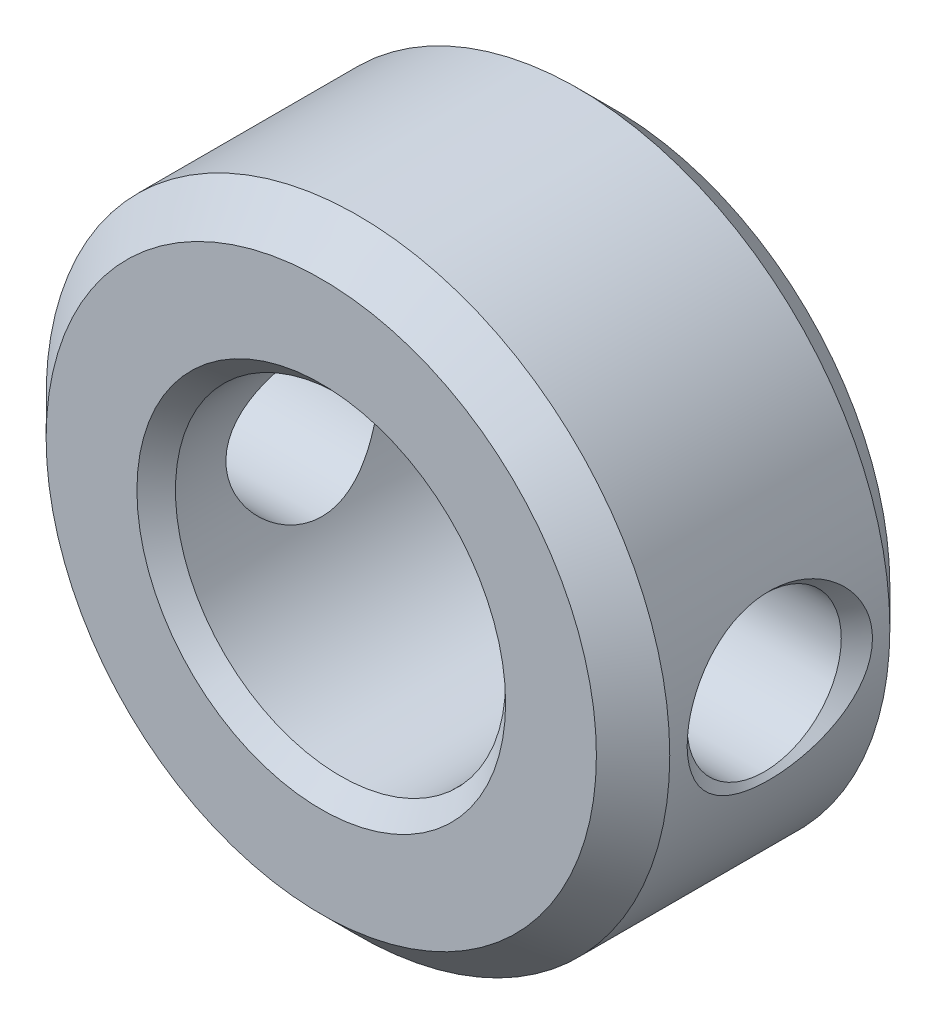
from build123d import *

# Parameters (mm, degrees)
ESQUISSE1_R        = 8.5
BOSS_EXTRU_1_DEPTH = 8
CHANFREIN1_SIZE    = 1


with BuildPart() as part:
    # Esquisse1 → Boss.-Extru.1 (new body)
    with BuildSketch(Plane.XY):
        Circle(ESQUISSE1_R)
    extrude(amount=BOSS_EXTRU_1_DEPTH)

    # Chanfrein1
    chanfrein1_edges = [part.edges().sort_by_distance(p)[0] for p in [
        (-8.5, 0, 0),
        (-8.5, 0, 8),
    ]]
    chamfer(chanfrein1_edges, length=CHANFREIN1_SIZE)

    # Esquisse13 → Trou taraud_ M10x1.02 (revolve, cut)
    with BuildSketch(Plane(origin=(0, 0, 8), x_dir=(0, -1, 0), z_dir=(1, 0, 0))):
        Polygon((0, 0), (0, 8), (5.025, 8), (4.5, 7.475), (4.5, 0.525), (5.025, 0), align=None)
    revolve(axis=Axis((0, 0, 14.35), (0, 0, -1)), mode=Mode.SUBTRACT)

    # Esquisse16 → Trou taraud_ M51 (revolve, cut)
    with BuildSketch(Plane(origin=(0, 0, 4), x_dir=(0, 0, 1), z_dir=(0, 1, 0))):
        Polygon((0, 0), (0, 8.5), (2.525, 8.5), (2.1, 8.075), (2.1, 0.425), (2.525, 0), align=None)
    revolve(axis=Axis((-6.35, 0, 4), (1, 0, 0)), mode=Mode.SUBTRACT)

    # Esquisse18 → Trou taraud_ M52 (revolve, cut)
    with BuildSketch(Plane(origin=(0, 0, 4), x_dir=(0, 0, -1), z_dir=(0, 1, 0))):
        Polygon((0, 0), (0, 8.5), (2.525, 8.5), (2.1, 8.075), (2.1, 0.425), (2.525, 0), align=None)
    revolve(axis=Axis((6.35, 0, 4), (-1, 0, 0)), mode=Mode.SUBTRACT)


solid = part.part
